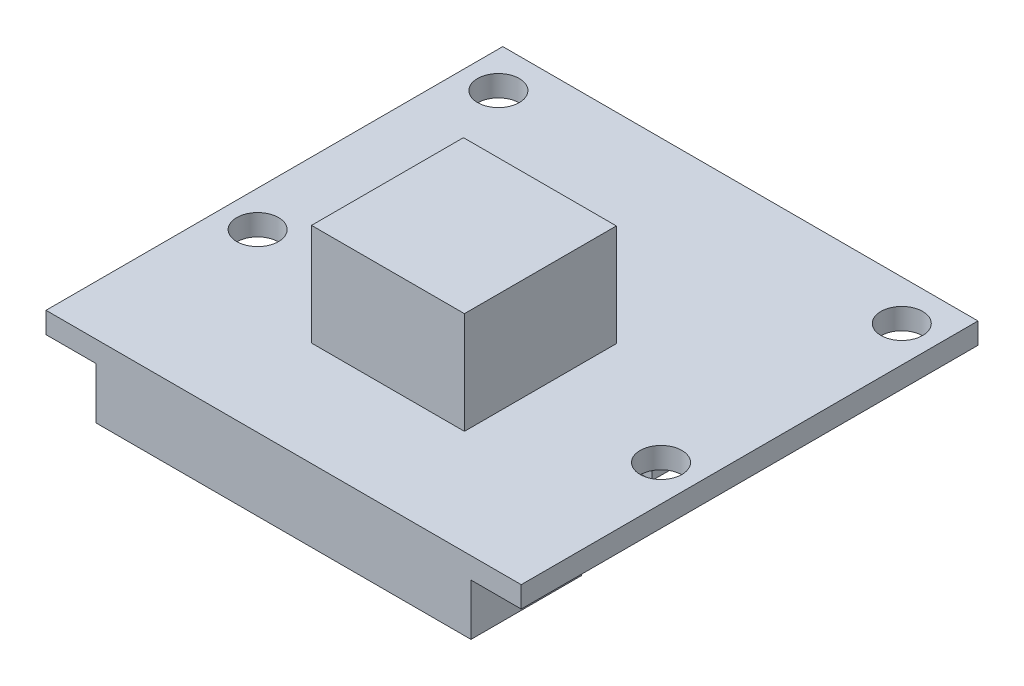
from build123d import *

# Parameters (mm, degrees)
SKETCH1_W           = 24.8666
SKETCH1_H           = 23.9014
SKETCH1_R           = 1.0922
BOSS_EXTRUDE1_DEPTH = 1.1049
SKETCH2_W           = 17.526
SKETCH2_H           = 11.684
BOSS_EXTRUDE2_DEPTH = 1.27
SKETCH3_W           = 19.6088
SKETCH3_H           = 5.7785
BOSS_EXTRUDE3_DEPTH = 2.6924
SKETCH4_W           = 8.001
SKETCH4_H           = 7.9502
BOSS_EXTRUDE4_DEPTH = 5.334


with BuildPart() as part:
    # Sketch1 → Boss-Extrude1 (new body)
    with BuildSketch(Plane(origin=(0, 0, 0), x_dir=(1, 0, 0), z_dir=(0, 1, 0))):
        with Locations((12.4333, 11.9507)):
            Rectangle(SKETCH1_W, SKETCH1_H)
        with Locations(Location((1.8796, 21.7932, 0), (0, 0, 270))):
            Circle(SKETCH1_R, mode=Mode.SUBTRACT)
        with Locations(Location((1.8796, 9.1948, 0), (0, 0, 270))):
            Circle(SKETCH1_R, mode=Mode.SUBTRACT)
        with Locations(Location((22.987, 21.7932, 0), (0, 0, 270))):
            Circle(SKETCH1_R, mode=Mode.SUBTRACT)
        with Locations(Location((22.987, 9.1948, 0), (0, 0, 270))):
            Circle(SKETCH1_R, mode=Mode.SUBTRACT)
    extrude(amount=BOSS_EXTRUDE1_DEPTH)

    # Sketch2 → Boss-Extrude2 (add)
    with BuildSketch(Plane.XZ):
        with Locations((12.4333, -16.3576)):
            Rectangle(SKETCH2_W, SKETCH2_H)
    extrude(amount=BOSS_EXTRUDE2_DEPTH)

    # Sketch3 → Boss-Extrude3 (add)
    with BuildSketch(Plane.XZ):
        with Locations((12.4333, -2.88925)):
            Rectangle(SKETCH3_W, SKETCH3_H)
    extrude(amount=BOSS_EXTRUDE3_DEPTH)

    # Sketch4 → Boss-Extrude4 (add)
    with BuildSketch(Plane(origin=(0, 1.1049, 0), x_dir=(1, 0, 0), z_dir=(0, 1, 0))):
        with Locations((12.4333, 9.4361)):
            Rectangle(SKETCH4_W, SKETCH4_H)
    extrude(amount=BOSS_EXTRUDE4_DEPTH)


solid = part.part
